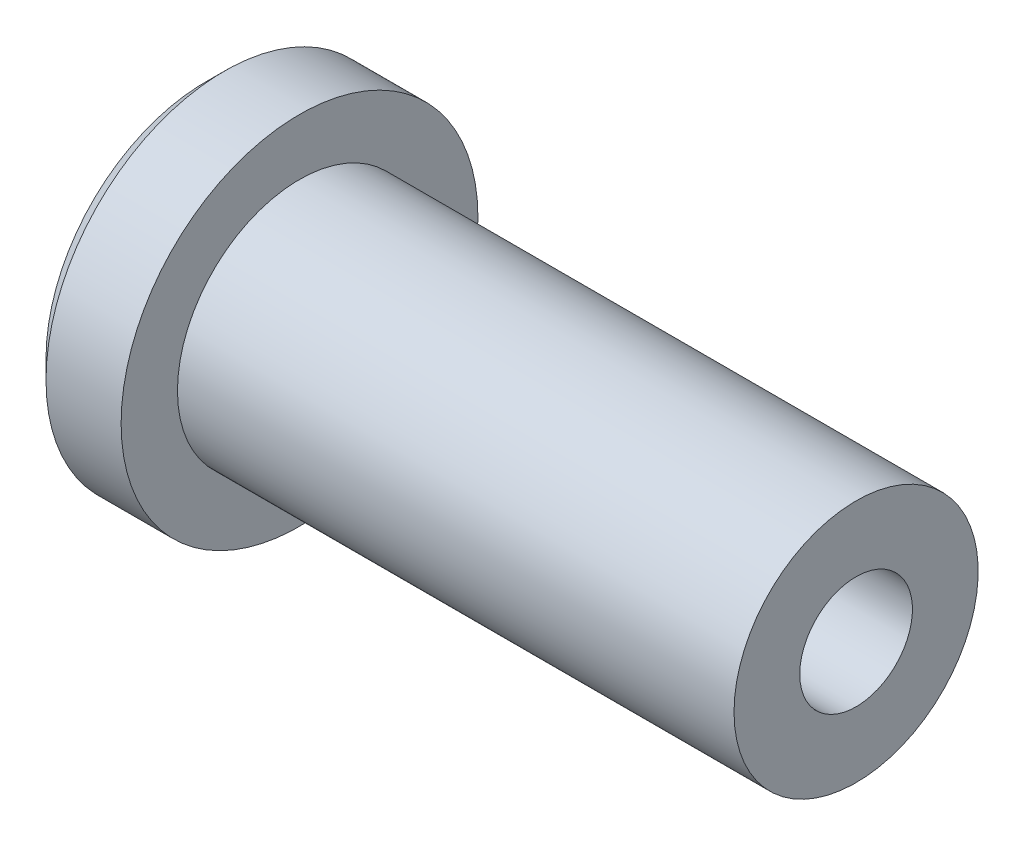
ISO-10303-21;
HEADER;
FILE_DESCRIPTION(('STEP AP214'),'2;1');
FILE_NAME('part.step','',(''),(''),'','','');
FILE_SCHEMA(('AUTOMOTIVE_DESIGN { 1 0 10303 214 1 1 1 1 }'));
ENDSEC;
DATA;
#1=APPLICATION_CONTEXT('core data for automotive mechanical design processes');
#2=APPLICATION_PROTOCOL_DEFINITION('international standard','automotive_design',2000,#1);
#3=PRODUCT_CONTEXT('',#1,'mechanical');
#4=PRODUCT('Part','Part','',(#3));
#5=PRODUCT_RELATED_PRODUCT_CATEGORY('part','',(#4));
#6=PRODUCT_DEFINITION_FORMATION('','',#4);
#7=PRODUCT_DEFINITION_CONTEXT('part definition',#1,'design');
#8=PRODUCT_DEFINITION('design','',#6,#7);
#9=PRODUCT_DEFINITION_SHAPE('','',#8);
#10=(LENGTH_UNIT() NAMED_UNIT(*) SI_UNIT(.MILLI.,.METRE.));
#11=(NAMED_UNIT(*) PLANE_ANGLE_UNIT() SI_UNIT($,.RADIAN.));
#12=(NAMED_UNIT(*) SI_UNIT($,.STERADIAN.) SOLID_ANGLE_UNIT());
#13=UNCERTAINTY_MEASURE_WITH_UNIT(LENGTH_MEASURE(1.E-05),#10,'distance_accuracy_value','');
#14=(GEOMETRIC_REPRESENTATION_CONTEXT(3) GLOBAL_UNCERTAINTY_ASSIGNED_CONTEXT((#13)) GLOBAL_UNIT_ASSIGNED_CONTEXT((#10,
#11,#12)) REPRESENTATION_CONTEXT('',''));
#15=CARTESIAN_POINT('',(0.,0.,0.));
#16=DIRECTION('',(0.,0.,1.));
#17=DIRECTION('',(1.,0.,0.));
#18=AXIS2_PLACEMENT_3D('',#15,#16,#17);
#19=CARTESIAN_POINT('',(0.,0.,0.));
#20=DIRECTION('',(1.,0.,0.));
#21=DIRECTION('',(0.,0.,-1.));
#22=AXIS2_PLACEMENT_3D('',#19,#20,#21);
#23=PLANE('',#22);
#24=CARTESIAN_POINT('',(0.,0.,0.));
#25=DIRECTION('',(-1.,0.,0.));
#26=DIRECTION('',(0.,0.,1.));
#27=AXIS2_PLACEMENT_3D('',#24,#25,#26);
#28=CIRCLE('',#27,9.);
#29=CARTESIAN_POINT('',(0.,0.,9.));
#30=VERTEX_POINT('',#29);
#31=EDGE_CURVE('E51',#30,#30,#28,.T.);
#32=ORIENTED_EDGE('',*,*,#31,.F.);
#33=EDGE_LOOP('',(#32));
#34=FACE_BOUND('',#33,.T.);
#35=CARTESIAN_POINT('',(0.,0.,0.));
#36=DIRECTION('',(-1.,0.,0.));
#37=DIRECTION('',(0.,0.,1.));
#38=AXIS2_PLACEMENT_3D('',#35,#36,#37);
#39=CIRCLE('',#38,17.);
#40=CARTESIAN_POINT('',(0.,0.,17.));
#41=VERTEX_POINT('',#40);
#42=EDGE_CURVE('E10',#41,#41,#39,.T.);
#43=ORIENTED_EDGE('',*,*,#42,.T.);
#44=EDGE_LOOP('',(#43));
#45=FACE_BOUND('',#44,.T.);
#46=ADVANCED_FACE('F26',(#34,#45),#23,.F.);
#47=CARTESIAN_POINT('',(1.99999999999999,0.,0.));
#48=DIRECTION('',(1.,0.,0.));
#49=DIRECTION('',(0.,0.,-1.));
#50=AXIS2_PLACEMENT_3D('',#47,#48,#49);
#51=CONICAL_SURFACE('',#50,19.,0.78539816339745);
#52=ORIENTED_EDGE('',*,*,#42,.F.);
#53=EDGE_LOOP('',(#52));
#54=FACE_BOUND('',#53,.T.);
#55=CARTESIAN_POINT('',(1.99999999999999,0.,0.));
#56=DIRECTION('',(-1.,0.,0.));
#57=DIRECTION('',(0.,0.,1.));
#58=AXIS2_PLACEMENT_3D('',#55,#56,#57);
#59=CIRCLE('',#58,19.);
#60=CARTESIAN_POINT('',(1.99999999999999,0.,19.));
#61=VERTEX_POINT('',#60);
#62=EDGE_CURVE('E32',#61,#61,#59,.T.);
#63=ORIENTED_EDGE('',*,*,#62,.T.);
#64=EDGE_LOOP('',(#63));
#65=FACE_BOUND('',#64,.T.);
#66=ADVANCED_FACE('F77',(#54,#65),#51,.T.);
#67=CARTESIAN_POINT('',(-10.,0.,0.));
#68=DIRECTION('',(-1.,0.,0.));
#69=DIRECTION('',(0.,0.,1.));
#70=AXIS2_PLACEMENT_3D('',#67,#68,#69);
#71=CYLINDRICAL_SURFACE('',#70,19.);
#72=ORIENTED_EDGE('',*,*,#62,.F.);
#73=EDGE_LOOP('',(#72));
#74=FACE_BOUND('',#73,.T.);
#75=CARTESIAN_POINT('',(10.,0.,0.));
#76=DIRECTION('',(-1.,0.,0.));
#77=DIRECTION('',(0.,0.,1.));
#78=AXIS2_PLACEMENT_3D('',#75,#76,#77);
#79=CIRCLE('',#78,19.);
#80=CARTESIAN_POINT('',(10.,0.,19.));
#81=VERTEX_POINT('',#80);
#82=EDGE_CURVE('E36',#81,#81,#79,.T.);
#83=ORIENTED_EDGE('',*,*,#82,.T.);
#84=EDGE_LOOP('',(#83));
#85=FACE_BOUND('',#84,.T.);
#86=ADVANCED_FACE('F81',(#74,#85),#71,.T.);
#87=CARTESIAN_POINT('',(10.,19.,0.));
#88=DIRECTION('',(-1.,0.,0.));
#89=DIRECTION('',(0.,0.,1.));
#90=AXIS2_PLACEMENT_3D('',#87,#88,#89);
#91=PLANE('',#90);
#92=ORIENTED_EDGE('',*,*,#82,.F.);
#93=EDGE_LOOP('',(#92));
#94=FACE_BOUND('',#93,.T.);
#95=CARTESIAN_POINT('',(10.,0.,0.));
#96=DIRECTION('',(-1.,0.,0.));
#97=DIRECTION('',(0.,0.,1.));
#98=AXIS2_PLACEMENT_3D('',#95,#96,#97);
#99=CIRCLE('',#98,13.);
#100=CARTESIAN_POINT('',(10.,0.,13.));
#101=VERTEX_POINT('',#100);
#102=EDGE_CURVE('E40',#101,#101,#99,.T.);
#103=ORIENTED_EDGE('',*,*,#102,.T.);
#104=EDGE_LOOP('',(#103));
#105=FACE_BOUND('',#104,.T.);
#106=ADVANCED_FACE('F86',(#94,#105),#91,.F.);
#107=CARTESIAN_POINT('',(-10.,0.,0.));
#108=DIRECTION('',(-1.,0.,0.));
#109=DIRECTION('',(0.,0.,1.));
#110=AXIS2_PLACEMENT_3D('',#107,#108,#109);
#111=CYLINDRICAL_SURFACE('',#110,13.);
#112=ORIENTED_EDGE('',*,*,#102,.F.);
#113=EDGE_LOOP('',(#112));
#114=FACE_BOUND('',#113,.T.);
#115=CARTESIAN_POINT('',(69.272,0.,0.));
#116=DIRECTION('',(-1.,0.,0.));
#117=DIRECTION('',(0.,0.,1.));
#118=AXIS2_PLACEMENT_3D('',#115,#116,#117);
#119=CIRCLE('',#118,13.);
#120=CARTESIAN_POINT('',(69.272,0.,13.));
#121=VERTEX_POINT('',#120);
#122=EDGE_CURVE('E45',#121,#121,#119,.T.);
#123=ORIENTED_EDGE('',*,*,#122,.T.);
#124=EDGE_LOOP('',(#123));
#125=FACE_BOUND('',#124,.T.);
#126=ADVANCED_FACE('F92',(#114,#125),#111,.T.);
#127=CARTESIAN_POINT('',(69.272,13.,0.));
#128=DIRECTION('',(-1.,0.,0.));
#129=DIRECTION('',(0.,0.,1.));
#130=AXIS2_PLACEMENT_3D('',#127,#128,#129);
#131=PLANE('',#130);
#132=CARTESIAN_POINT('',(69.272,0.,0.));
#133=DIRECTION('',(-1.,0.,0.));
#134=DIRECTION('',(0.,0.,1.));
#135=AXIS2_PLACEMENT_3D('',#132,#133,#134);
#136=CIRCLE('',#135,6.);
#137=CARTESIAN_POINT('',(69.272,0.,6.));
#138=VERTEX_POINT('',#137);
#139=EDGE_CURVE('E54',#138,#138,#136,.T.);
#140=ORIENTED_EDGE('',*,*,#139,.T.);
#141=EDGE_LOOP('',(#140));
#142=FACE_BOUND('',#141,.T.);
#143=ORIENTED_EDGE('',*,*,#122,.F.);
#144=EDGE_LOOP('',(#143));
#145=FACE_BOUND('',#144,.T.);
#146=ADVANCED_FACE('F72',(#142,#145),#131,.F.);
#147=CARTESIAN_POINT('',(14.,0.,0.));
#148=DIRECTION('',(-1.,0.,0.));
#149=DIRECTION('',(0.,0.,1.));
#150=AXIS2_PLACEMENT_3D('',#147,#148,#149);
#151=CYLINDRICAL_SURFACE('',#150,9.);
#152=CARTESIAN_POINT('',(14.,0.,0.));
#153=DIRECTION('',(-1.,0.,0.));
#154=DIRECTION('',(0.,0.,1.));
#155=AXIS2_PLACEMENT_3D('',#152,#153,#154);
#156=CIRCLE('',#155,9.);
#157=CARTESIAN_POINT('',(14.,0.,9.));
#158=VERTEX_POINT('',#157);
#159=EDGE_CURVE('E48',#158,#158,#156,.T.);
#160=ORIENTED_EDGE('',*,*,#159,.F.);
#161=EDGE_LOOP('',(#160));
#162=FACE_BOUND('',#161,.T.);
#163=ORIENTED_EDGE('',*,*,#31,.T.);
#164=EDGE_LOOP('',(#163));
#165=FACE_BOUND('',#164,.T.);
#166=ADVANCED_FACE('F66',(#162,#165),#151,.F.);
#167=CARTESIAN_POINT('',(14.,0.,0.));
#168=DIRECTION('',(-1.,0.,0.));
#169=DIRECTION('',(0.,0.,1.));
#170=AXIS2_PLACEMENT_3D('',#167,#168,#169);
#171=PLANE('',#170);
#172=CARTESIAN_POINT('',(14.,0.,0.));
#173=DIRECTION('',(-1.,0.,0.));
#174=DIRECTION('',(0.,0.,1.));
#175=AXIS2_PLACEMENT_3D('',#172,#173,#174);
#176=CIRCLE('',#175,6.);
#177=CARTESIAN_POINT('',(14.,0.,6.));
#178=VERTEX_POINT('',#177);
#179=EDGE_CURVE('E57',#178,#178,#176,.T.);
#180=ORIENTED_EDGE('',*,*,#179,.F.);
#181=EDGE_LOOP('',(#180));
#182=FACE_BOUND('',#181,.T.);
#183=ORIENTED_EDGE('',*,*,#159,.T.);
#184=EDGE_LOOP('',(#183));
#185=FACE_BOUND('',#184,.T.);
#186=ADVANCED_FACE('F63',(#182,#185),#171,.T.);
#187=CARTESIAN_POINT('',(69.272,0.,0.));
#188=DIRECTION('',(-1.,0.,0.));
#189=DIRECTION('',(0.,0.,1.));
#190=AXIS2_PLACEMENT_3D('',#187,#188,#189);
#191=CYLINDRICAL_SURFACE('',#190,6.);
#192=ORIENTED_EDGE('',*,*,#139,.F.);
#193=EDGE_LOOP('',(#192));
#194=FACE_BOUND('',#193,.T.);
#195=ORIENTED_EDGE('',*,*,#179,.T.);
#196=EDGE_LOOP('',(#195));
#197=FACE_BOUND('',#196,.T.);
#198=ADVANCED_FACE('F61',(#194,#197),#191,.F.);
#199=CLOSED_SHELL('',(#46,#66,#86,#106,#126,#146,#166,#186,#198));
#200=MANIFOLD_SOLID_BREP('B2',#199);
#201=ADVANCED_BREP_SHAPE_REPRESENTATION('',(#18,#200),#14);
#202=SHAPE_DEFINITION_REPRESENTATION(#9,#201);
ENDSEC;
END-ISO-10303-21;
